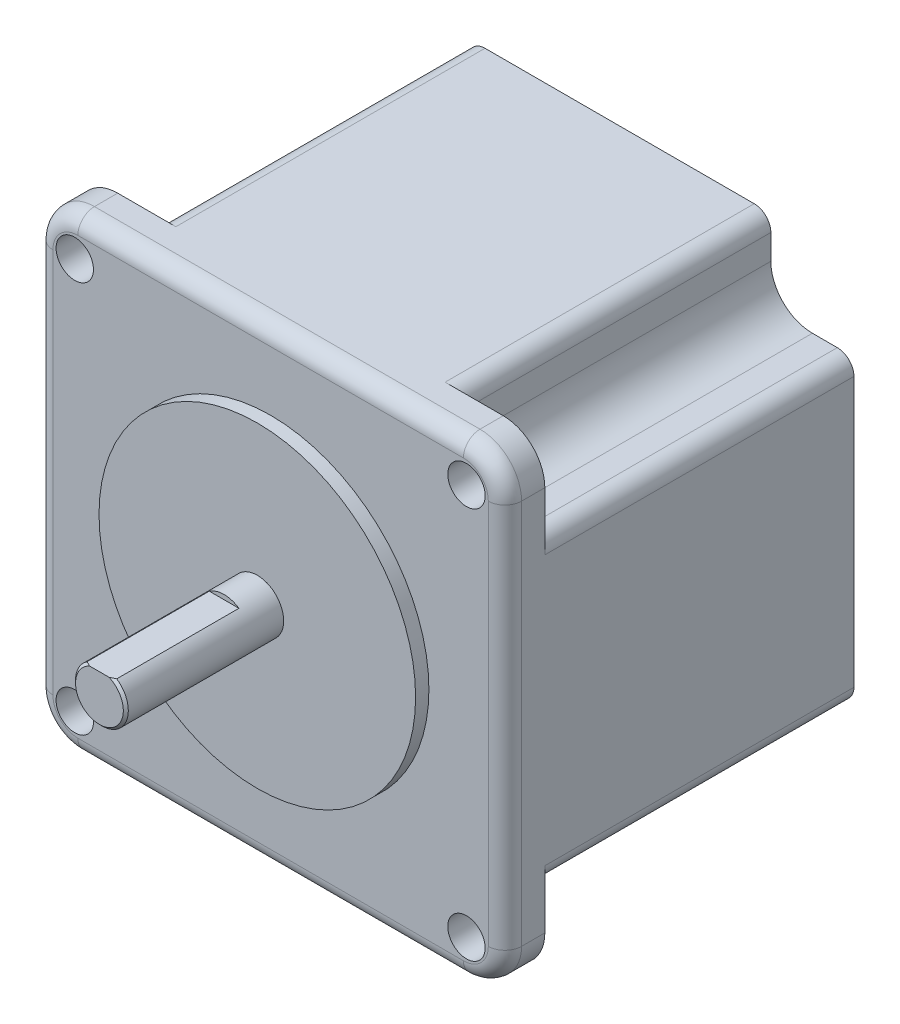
from build123d import *

# Parameters (mm, degrees)
SKETCH_1_R          = 19.05
EXTRUDE_1_DEPTH     = 1.6
SKETCH_2_R          = 3.175
EXTRUDE_2_DEPTH     = 19
CUT_EXTRUDE_1_DEPTH = 15
EXTRUDE_3_DEPTH     = 42
FILLET_1_R          = 2
CUT_EXTRUDE_START   = -37.2
CUT_EXTRUDE_2_DEPTH = 37.2
SKETCH_9_R          = 2.25
CUT_EXTRUDE_3_DEPTH = 37.2
CHAMFER_1_SIZE      = 0.3


with BuildPart() as part:
    # Sketch 1 → Extrude 1 (new body)
    with BuildSketch(Plane.XY):
        Circle(SKETCH_1_R)
    extrude(amount=-EXTRUDE_1_DEPTH)

    # Sketch 2 → Extrude 2 (add)
    with BuildSketch(Plane.XY):
        Circle(SKETCH_2_R)
    extrude(amount=EXTRUDE_2_DEPTH)

    # Sketch 3 → Cut-Extrude 1 (cut)
    with BuildSketch(Plane.XY.offset(19)):
        Polygon((0, 2.625), (3.175, 2.625), (3.175, 4.871585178), (-4.500652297, 4.871585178), (-4.500652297, 2.625), align=None)
    extrude(amount=-CUT_EXTRUDE_1_DEPTH, mode=Mode.SUBTRACT)

    # Sketch 4 → Extrude 3 (add)
    with BuildSketch(Plane(origin=(0, 0, -1.6), x_dir=(-1, 0, 0), z_dir=(0, 0, -1))):
        with BuildLine():
            Line((0, 28.2), (23.2, 28.2))
            ThreePointArc((23.2, 28.2), (26.735533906, 26.735533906), (28.2, 23.2))
            Line((28.2, 23.2), (28.2, -23.2))
            ThreePointArc((28.2, -23.2), (26.735533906, -26.735533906), (23.2, -28.2))
            Line((23.2, -28.2), (-23.2, -28.2))
            ThreePointArc((-23.2, -28.2), (-26.735533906, -26.735533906), (-28.2, -23.2))
            Line((-28.2, -23.2), (-28.2, 23.2))
            ThreePointArc((-28.2, 23.2), (-26.735533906, 26.735533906), (-23.2, 28.2))
            Line((-23.2, 28.2), (0, 28.2))
        make_face()
    extrude(amount=EXTRUDE_3_DEPTH)

    # Fillet 1
    fillet_1_edges = [part.edges().sort_by_distance(p)[0] for p in [
        (26.735533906, -26.735533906, -1.6),
        (0, -28.2, -1.6),
        (-26.735533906, -26.735533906, -1.6),
        (-28.2, 0, -1.6),
        (-26.735533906, 26.735533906, -1.6),
        (0, 28.2, -1.6),
        (26.735533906, 26.735533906, -1.6),
        (28.2, 0, -1.6),
    ]]
    fillet(fillet_1_edges, radius=FILLET_1_R)

    # Sketch 7 → Cut-Extrude 2 (cut)
    with BuildSketch(Plane(origin=(0, 0, -43.6), x_dir=(-1, 0, 0), z_dir=(0, 0, -1)).offset(CUT_EXTRUDE_START)):
        with BuildLine():
            Line((10.12096501, 28.2), (16.2, 28.2))
            ThreePointArc((16.2, 28.2), (17.614213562, 27.614213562), (18.2, 26.2))
            Line((18.2, 26.2), (18.2, 23.2))
            ThreePointArc((18.2, 23.2), (19.664466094, 19.664466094), (23.2, 18.2))
            Line((23.2, 18.2), (26.2, 18.2))
            ThreePointArc((26.2, 18.2), (27.614213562, 17.614213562), (28.2, 16.2))
            Line((28.2, 16.2), (28.2, 11.604260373))
            Line((28.2, 11.604260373), (36.386860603, 11.604260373))
            Line((36.386860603, 11.604260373), (36.386860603, 38.649435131))
            Line((36.386860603, 38.649435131), (10.12096501, 38.649435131))
            Line((10.12096501, 38.649435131), (10.12096501, 28.2))
        make_face()
        with BuildLine():
            Line((-10.12096501, 38.649435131), (-10.12096501, 28.2))
            Line((-10.12096501, 28.2), (-16.2, 28.2))
            ThreePointArc((-16.2, 28.2), (-17.614213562, 27.614213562), (-18.2, 26.2))
            Line((-18.2, 26.2), (-18.2, 23.2))
            ThreePointArc((-18.2, 23.2), (-19.664466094, 19.664466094), (-23.2, 18.2))
            Line((-23.2, 18.2), (-26.2, 18.2))
            ThreePointArc((-26.2, 18.2), (-27.614213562, 17.614213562), (-28.2, 16.2))
            Line((-28.2, 16.2), (-28.2, 11.604260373))
            Line((-28.2, 11.604260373), (-36.386860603, 11.604260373))
            Line((-36.386860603, 11.604260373), (-36.386860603, 38.649435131))
            Line((-36.386860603, 38.649435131), (-10.12096501, 38.649435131))
        make_face()
        with BuildLine():
            Line((10.12096501, -38.649435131), (10.12096501, -28.2))
            Line((10.12096501, -28.2), (16.2, -28.2))
            ThreePointArc((16.2, -28.2), (17.614213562, -27.614213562), (18.2, -26.2))
            Line((18.2, -26.2), (18.2, -23.2))
            ThreePointArc((18.2, -23.2), (19.664466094, -19.664466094), (23.2, -18.2))
            Line((23.2, -18.2), (26.2, -18.2))
            ThreePointArc((26.2, -18.2), (27.614213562, -17.614213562), (28.2, -16.2))
            Line((28.2, -16.2), (28.2, -11.604260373))
            Line((28.2, -11.604260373), (36.386860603, -11.604260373))
            Line((36.386860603, -11.604260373), (36.386860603, -38.649435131))
            Line((36.386860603, -38.649435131), (10.12096501, -38.649435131))
        make_face()
        with BuildLine():
            Line((-10.12096501, -28.2), (-16.2, -28.2))
            ThreePointArc((-16.2, -28.2), (-17.614213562, -27.614213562), (-18.2, -26.2))
            Line((-18.2, -26.2), (-18.2, -23.2))
            ThreePointArc((-18.2, -23.2), (-19.664466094, -19.664466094), (-23.2, -18.2))
            Line((-23.2, -18.2), (-26.2, -18.2))
            ThreePointArc((-26.2, -18.2), (-27.614213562, -17.614213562), (-28.2, -16.2))
            Line((-28.2, -16.2), (-28.2, -11.604260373))
            Line((-28.2, -11.604260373), (-36.386860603, -11.604260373))
            Line((-36.386860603, -11.604260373), (-36.386860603, -38.649435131))
            Line((-36.386860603, -38.649435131), (-10.12096501, -38.649435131))
            Line((-10.12096501, -38.649435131), (-10.12096501, -28.2))
        make_face()
    extrude(amount=CUT_EXTRUDE_2_DEPTH, mode=Mode.SUBTRACT)

    # Sketch 9 → Cut-Extrude 3 (cut)
    with BuildSketch(Plane.XY.offset(-1.6)):
        with Locations((-23.57, 23.57)):
            Circle(SKETCH_9_R)
        with Locations((23.57, 23.57)):
            Circle(SKETCH_9_R)
        with Locations((23.57, -23.57)):
            Circle(SKETCH_9_R)
        with Locations((-23.57, -23.57)):
            Circle(SKETCH_9_R)
    extrude(amount=-CUT_EXTRUDE_3_DEPTH, mode=Mode.SUBTRACT)

    # Chamfer 1
    chamfer_1_edges = [part.edges().sort_by_distance(p)[0] for p in [
        (-1.48490634, -2.806363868, 19),
    ]]
    chamfer(chamfer_1_edges, length=CHAMFER_1_SIZE)


solid = part.part
